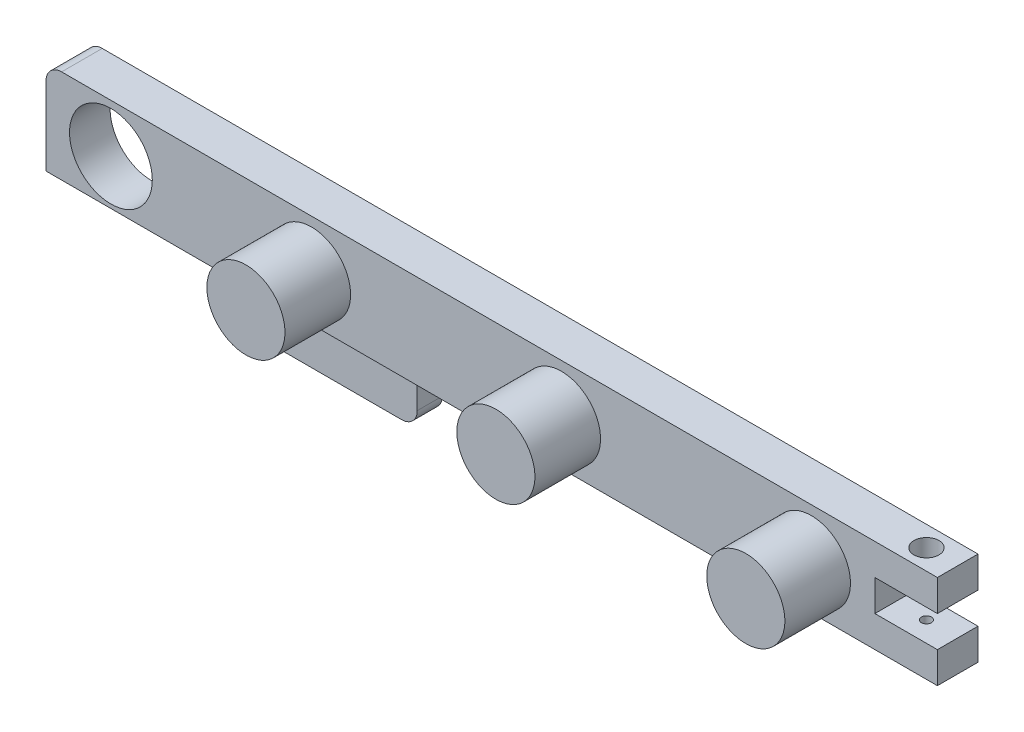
ISO-10303-21;
HEADER;
FILE_DESCRIPTION(('STEP AP214'),'2;1');
FILE_NAME('part.step','',(''),(''),'','','');
FILE_SCHEMA(('AUTOMOTIVE_DESIGN { 1 0 10303 214 1 1 1 1 }'));
ENDSEC;
DATA;
#1=APPLICATION_CONTEXT('core data for automotive mechanical design processes');
#2=APPLICATION_PROTOCOL_DEFINITION('international standard','automotive_design',2000,#1);
#3=PRODUCT_CONTEXT('',#1,'mechanical');
#4=PRODUCT('Part','Part','',(#3));
#5=PRODUCT_RELATED_PRODUCT_CATEGORY('part','',(#4));
#6=PRODUCT_DEFINITION_FORMATION('','',#4);
#7=PRODUCT_DEFINITION_CONTEXT('part definition',#1,'design');
#8=PRODUCT_DEFINITION('design','',#6,#7);
#9=PRODUCT_DEFINITION_SHAPE('','',#8);
#10=(LENGTH_UNIT() NAMED_UNIT(*) SI_UNIT(.MILLI.,.METRE.));
#11=(NAMED_UNIT(*) PLANE_ANGLE_UNIT() SI_UNIT($,.RADIAN.));
#12=(NAMED_UNIT(*) SI_UNIT($,.STERADIAN.) SOLID_ANGLE_UNIT());
#13=UNCERTAINTY_MEASURE_WITH_UNIT(LENGTH_MEASURE(1.E-05),#10,'distance_accuracy_value','');
#14=(GEOMETRIC_REPRESENTATION_CONTEXT(3) GLOBAL_UNCERTAINTY_ASSIGNED_CONTEXT((#13)) GLOBAL_UNIT_ASSIGNED_CONTEXT((#10,
#11,#12)) REPRESENTATION_CONTEXT('',''));
#15=CARTESIAN_POINT('',(0.,0.,0.));
#16=DIRECTION('',(0.,0.,1.));
#17=DIRECTION('',(1.,0.,0.));
#18=AXIS2_PLACEMENT_3D('',#15,#16,#17);
#19=CARTESIAN_POINT('',(85.,14.5,26.));
#20=DIRECTION('',(0.,0.,-1.));
#21=DIRECTION('',(-1.,0.,0.));
#22=AXIS2_PLACEMENT_3D('',#19,#20,#21);
#23=CYLINDRICAL_SURFACE('',#22,12.5);
#24=CARTESIAN_POINT('',(85.,14.5,13.));
#25=DIRECTION('',(0.,0.,1.));
#26=DIRECTION('',(1.,0.,0.));
#27=AXIS2_PLACEMENT_3D('',#24,#25,#26);
#28=CIRCLE('',#27,12.5);
#29=CARTESIAN_POINT('',(72.5,14.5,13.));
#30=VERTEX_POINT('',#29);
#31=EDGE_CURVE('E201',#30,#30,#28,.T.);
#32=CARTESIAN_POINT('',(85.,14.5,34.));
#33=DIRECTION('',(0.,0.,1.));
#34=DIRECTION('',(1.,0.,0.));
#35=AXIS2_PLACEMENT_3D('',#32,#33,#34);
#36=CIRCLE('',#35,12.5);
#37=CARTESIAN_POINT('',(72.5,14.5,34.));
#38=VERTEX_POINT('',#37);
#39=EDGE_CURVE('E455',#38,#38,#36,.T.);
#40=CARTESIAN_POINT('',(72.5,14.5,13.));
#41=CARTESIAN_POINT('',(72.5,14.5,13.21875));
#42=CARTESIAN_POINT('',(72.5,14.5,13.4375));
#43=CARTESIAN_POINT('',(72.5,14.5,13.875));
#44=CARTESIAN_POINT('',(72.5,14.5,14.09375));
#45=CARTESIAN_POINT('',(72.5,14.5,14.53125));
#46=CARTESIAN_POINT('',(72.5,14.5,14.75));
#47=CARTESIAN_POINT('',(72.5,14.5,15.1875));
#48=CARTESIAN_POINT('',(72.5,14.5,15.40625));
#49=CARTESIAN_POINT('',(72.5,14.5,15.84375));
#50=CARTESIAN_POINT('',(72.5,14.5,16.0625));
#51=CARTESIAN_POINT('',(72.5,14.5,16.5));
#52=CARTESIAN_POINT('',(72.5,14.5,16.71875));
#53=CARTESIAN_POINT('',(72.5,14.5,17.15625));
#54=CARTESIAN_POINT('',(72.5,14.5,17.375));
#55=CARTESIAN_POINT('',(72.5,14.5,17.8125));
#56=CARTESIAN_POINT('',(72.5,14.5,18.03125));
#57=CARTESIAN_POINT('',(72.5,14.5,18.46875));
#58=CARTESIAN_POINT('',(72.5,14.5,18.6875));
#59=CARTESIAN_POINT('',(72.5,14.5,19.125));
#60=CARTESIAN_POINT('',(72.5,14.5,19.34375));
#61=CARTESIAN_POINT('',(72.5,14.5,19.78125));
#62=CARTESIAN_POINT('',(72.5,14.5,20.));
#63=CARTESIAN_POINT('',(72.5,14.5,20.4375));
#64=CARTESIAN_POINT('',(72.5,14.5,20.65625));
#65=CARTESIAN_POINT('',(72.5,14.5,21.09375));
#66=CARTESIAN_POINT('',(72.5,14.5,21.3125));
#67=CARTESIAN_POINT('',(72.5,14.5,21.75));
#68=CARTESIAN_POINT('',(72.5,14.5,21.96875));
#69=CARTESIAN_POINT('',(72.5,14.5,22.40625));
#70=CARTESIAN_POINT('',(72.5,14.5,22.625));
#71=CARTESIAN_POINT('',(72.5,14.5,23.0625));
#72=CARTESIAN_POINT('',(72.5,14.5,23.28125));
#73=CARTESIAN_POINT('',(72.5,14.5,23.71875));
#74=CARTESIAN_POINT('',(72.5,14.5,23.9375));
#75=CARTESIAN_POINT('',(72.5,14.5,24.375));
#76=CARTESIAN_POINT('',(72.5,14.5,24.59375));
#77=CARTESIAN_POINT('',(72.5,14.5,25.03125));
#78=CARTESIAN_POINT('',(72.5,14.5,25.25));
#79=CARTESIAN_POINT('',(72.5,14.5,25.6875));
#80=CARTESIAN_POINT('',(72.5,14.5,25.90625));
#81=CARTESIAN_POINT('',(72.5,14.5,26.34375));
#82=CARTESIAN_POINT('',(72.5,14.5,26.5625));
#83=CARTESIAN_POINT('',(72.5,14.5,27.));
#84=CARTESIAN_POINT('',(72.5,14.5,27.21875));
#85=CARTESIAN_POINT('',(72.5,14.5,27.65625));
#86=CARTESIAN_POINT('',(72.5,14.5,27.875));
#87=CARTESIAN_POINT('',(72.5,14.5,28.3125));
#88=CARTESIAN_POINT('',(72.5,14.5,28.53125));
#89=CARTESIAN_POINT('',(72.5,14.5,28.96875));
#90=CARTESIAN_POINT('',(72.5,14.5,29.1875));
#91=CARTESIAN_POINT('',(72.5,14.5,29.625));
#92=CARTESIAN_POINT('',(72.5,14.5,29.84375));
#93=CARTESIAN_POINT('',(72.5,14.5,30.28125));
#94=CARTESIAN_POINT('',(72.5,14.5,30.5));
#95=CARTESIAN_POINT('',(72.5,14.5,30.9375));
#96=CARTESIAN_POINT('',(72.5,14.5,31.15625));
#97=CARTESIAN_POINT('',(72.5,14.5,31.59375));
#98=CARTESIAN_POINT('',(72.5,14.5,31.8125));
#99=CARTESIAN_POINT('',(72.5,14.5,32.25));
#100=CARTESIAN_POINT('',(72.5,14.5,32.46875));
#101=CARTESIAN_POINT('',(72.5,14.5,32.90625));
#102=CARTESIAN_POINT('',(72.5,14.5,33.125));
#103=CARTESIAN_POINT('',(72.5,14.5,33.5625));
#104=CARTESIAN_POINT('',(72.5,14.5,33.78125));
#105=CARTESIAN_POINT('',(72.5,14.5,34.));
#106=B_SPLINE_CURVE_WITH_KNOTS('',3,(#40,#41,#42,#43,#44,#45,#46,#47,#48,#49,#50,#51,#52,#53,
#54,#55,#56,#57,#58,#59,#60,#61,#62,#63,#64,#65,#66,#67,#68,#69,#70,#71,#72,#73,#74,#75,#76,#77,
#78,#79,#80,#81,#82,#83,#84,#85,#86,#87,#88,#89,#90,#91,#92,#93,#94,#95,#96,#97,#98,#99,#100,
#101,#102,#103,#104,#105),.UNSPECIFIED.,.F.,.F.,(4,2,2,2,2,2,2,2,2,2,2,2,2,2,2,2,2,2,2,2,2,2,2,
2,2,2,2,2,2,2,2,2,4),(0.,0.656250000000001,1.3125,1.96875,2.625,3.28125,3.9375,4.59375,5.25,
5.90625,6.5625,7.21875,7.875,8.53125,9.1875,9.84375,10.5,11.15625,11.8125,12.46875,13.125,
13.78125,14.4375,15.09375,15.75,16.40625,17.0625,17.71875,18.375,19.03125,19.6875,20.34375,21.),.UNSPECIFIED.);
#107=EDGE_CURVE('BSEAM39',#30,#38,#106,.T.);
#108=ORIENTED_EDGE('',*,*,#31,.T.);
#109=ORIENTED_EDGE('',*,*,#39,.F.);
#110=ORIENTED_EDGE('',*,*,#107,.T.);
#111=ORIENTED_EDGE('',*,*,#107,.F.);
#112=EDGE_LOOP('',(#108,#110,#109,#111));
#113=FACE_BOUND('',#112,.T.);
#114=ADVANCED_FACE('F39',(#113),#23,.T.);
#115=CARTESIAN_POINT('',(165.,14.5,26.));
#116=DIRECTION('',(0.,0.,-1.));
#117=DIRECTION('',(-1.,0.,0.));
#118=AXIS2_PLACEMENT_3D('',#115,#116,#117);
#119=CYLINDRICAL_SURFACE('',#118,12.5);
#120=CARTESIAN_POINT('',(165.,14.5,13.));
#121=DIRECTION('',(0.,0.,1.));
#122=DIRECTION('',(1.,0.,0.));
#123=AXIS2_PLACEMENT_3D('',#120,#121,#122);
#124=CIRCLE('',#123,12.5);
#125=CARTESIAN_POINT('',(152.5,14.5,13.));
#126=VERTEX_POINT('',#125);
#127=EDGE_CURVE('E339',#126,#126,#124,.T.);
#128=CARTESIAN_POINT('',(165.,14.5,34.));
#129=DIRECTION('',(0.,0.,1.));
#130=DIRECTION('',(1.,0.,0.));
#131=AXIS2_PLACEMENT_3D('',#128,#129,#130);
#132=CIRCLE('',#131,12.5);
#133=CARTESIAN_POINT('',(152.5,14.5,34.));
#134=VERTEX_POINT('',#133);
#135=EDGE_CURVE('E457',#134,#134,#132,.T.);
#136=CARTESIAN_POINT('',(152.5,14.5,13.));
#137=CARTESIAN_POINT('',(152.5,14.5,13.21875));
#138=CARTESIAN_POINT('',(152.5,14.5,13.4375));
#139=CARTESIAN_POINT('',(152.5,14.5,13.875));
#140=CARTESIAN_POINT('',(152.5,14.5,14.09375));
#141=CARTESIAN_POINT('',(152.5,14.5,14.53125));
#142=CARTESIAN_POINT('',(152.5,14.5,14.75));
#143=CARTESIAN_POINT('',(152.5,14.5,15.1875));
#144=CARTESIAN_POINT('',(152.5,14.5,15.40625));
#145=CARTESIAN_POINT('',(152.5,14.5,15.84375));
#146=CARTESIAN_POINT('',(152.5,14.5,16.0625));
#147=CARTESIAN_POINT('',(152.5,14.5,16.5));
#148=CARTESIAN_POINT('',(152.5,14.5,16.71875));
#149=CARTESIAN_POINT('',(152.5,14.5,17.15625));
#150=CARTESIAN_POINT('',(152.5,14.5,17.375));
#151=CARTESIAN_POINT('',(152.5,14.5,17.8125));
#152=CARTESIAN_POINT('',(152.5,14.5,18.03125));
#153=CARTESIAN_POINT('',(152.5,14.5,18.46875));
#154=CARTESIAN_POINT('',(152.5,14.5,18.6875));
#155=CARTESIAN_POINT('',(152.5,14.5,19.125));
#156=CARTESIAN_POINT('',(152.5,14.5,19.34375));
#157=CARTESIAN_POINT('',(152.5,14.5,19.78125));
#158=CARTESIAN_POINT('',(152.5,14.5,20.));
#159=CARTESIAN_POINT('',(152.5,14.5,20.4375));
#160=CARTESIAN_POINT('',(152.5,14.5,20.65625));
#161=CARTESIAN_POINT('',(152.5,14.5,21.09375));
#162=CARTESIAN_POINT('',(152.5,14.5,21.3125));
#163=CARTESIAN_POINT('',(152.5,14.5,21.75));
#164=CARTESIAN_POINT('',(152.5,14.5,21.96875));
#165=CARTESIAN_POINT('',(152.5,14.5,22.40625));
#166=CARTESIAN_POINT('',(152.5,14.5,22.625));
#167=CARTESIAN_POINT('',(152.5,14.5,23.0625));
#168=CARTESIAN_POINT('',(152.5,14.5,23.28125));
#169=CARTESIAN_POINT('',(152.5,14.5,23.71875));
#170=CARTESIAN_POINT('',(152.5,14.5,23.9375));
#171=CARTESIAN_POINT('',(152.5,14.5,24.375));
#172=CARTESIAN_POINT('',(152.5,14.5,24.59375));
#173=CARTESIAN_POINT('',(152.5,14.5,25.03125));
#174=CARTESIAN_POINT('',(152.5,14.5,25.25));
#175=CARTESIAN_POINT('',(152.5,14.5,25.6875));
#176=CARTESIAN_POINT('',(152.5,14.5,25.90625));
#177=CARTESIAN_POINT('',(152.5,14.5,26.34375));
#178=CARTESIAN_POINT('',(152.5,14.5,26.5625));
#179=CARTESIAN_POINT('',(152.5,14.5,27.));
#180=CARTESIAN_POINT('',(152.5,14.5,27.21875));
#181=CARTESIAN_POINT('',(152.5,14.5,27.65625));
#182=CARTESIAN_POINT('',(152.5,14.5,27.875));
#183=CARTESIAN_POINT('',(152.5,14.5,28.3125));
#184=CARTESIAN_POINT('',(152.5,14.5,28.53125));
#185=CARTESIAN_POINT('',(152.5,14.5,28.96875));
#186=CARTESIAN_POINT('',(152.5,14.5,29.1875));
#187=CARTESIAN_POINT('',(152.5,14.5,29.625));
#188=CARTESIAN_POINT('',(152.5,14.5,29.84375));
#189=CARTESIAN_POINT('',(152.5,14.5,30.28125));
#190=CARTESIAN_POINT('',(152.5,14.5,30.5));
#191=CARTESIAN_POINT('',(152.5,14.5,30.9375));
#192=CARTESIAN_POINT('',(152.5,14.5,31.15625));
#193=CARTESIAN_POINT('',(152.5,14.5,31.59375));
#194=CARTESIAN_POINT('',(152.5,14.5,31.8125));
#195=CARTESIAN_POINT('',(152.5,14.5,32.25));
#196=CARTESIAN_POINT('',(152.5,14.5,32.46875));
#197=CARTESIAN_POINT('',(152.5,14.5,32.90625));
#198=CARTESIAN_POINT('',(152.5,14.5,33.125));
#199=CARTESIAN_POINT('',(152.5,14.5,33.5625));
#200=CARTESIAN_POINT('',(152.5,14.5,33.78125));
#201=CARTESIAN_POINT('',(152.5,14.5,34.));
#202=B_SPLINE_CURVE_WITH_KNOTS('',3,(#136,#137,#138,#139,#140,#141,#142,#143,#144,#145,#146,
#147,#148,#149,#150,#151,#152,#153,#154,#155,#156,#157,#158,#159,#160,#161,#162,#163,#164,#165,
#166,#167,#168,#169,#170,#171,#172,#173,#174,#175,#176,#177,#178,#179,#180,#181,#182,#183,#184,
#185,#186,#187,#188,#189,#190,#191,#192,#193,#194,#195,#196,#197,#198,#199,#200,#201),
.UNSPECIFIED.,.F.,.F.,(4,2,2,2,2,2,2,2,2,2,2,2,2,2,2,2,2,2,2,2,2,2,2,2,2,2,2,2,2,2,2,2,4),(0.,
0.656250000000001,1.3125,1.96875,2.625,3.28125,3.9375,4.59375,5.25,5.90625,6.5625,7.21875,7.875,
8.53125,9.1875,9.84375,10.5,11.15625,11.8125,12.46875,13.125,13.78125,14.4375,15.09375,15.75,
16.40625,17.0625,17.71875,18.375,19.03125,19.6875,20.34375,21.),.UNSPECIFIED.);
#203=EDGE_CURVE('BSEAM362',#126,#134,#202,.T.);
#204=ORIENTED_EDGE('',*,*,#127,.T.);
#205=ORIENTED_EDGE('',*,*,#135,.F.);
#206=ORIENTED_EDGE('',*,*,#203,.T.);
#207=ORIENTED_EDGE('',*,*,#203,.F.);
#208=EDGE_LOOP('',(#204,#206,#205,#207));
#209=FACE_BOUND('',#208,.T.);
#210=ADVANCED_FACE('F362',(#209),#119,.T.);
#211=CARTESIAN_POINT('',(245.,14.5,26.));
#212=DIRECTION('',(0.,0.,-1.));
#213=DIRECTION('',(-1.,0.,0.));
#214=AXIS2_PLACEMENT_3D('',#211,#212,#213);
#215=CYLINDRICAL_SURFACE('',#214,12.5);
#216=CARTESIAN_POINT('',(245.,14.5,13.));
#217=DIRECTION('',(0.,0.,1.));
#218=DIRECTION('',(1.,0.,0.));
#219=AXIS2_PLACEMENT_3D('',#216,#217,#218);
#220=CIRCLE('',#219,12.5);
#221=CARTESIAN_POINT('',(232.5,14.5,13.));
#222=VERTEX_POINT('',#221);
#223=EDGE_CURVE('E336',#222,#222,#220,.T.);
#224=CARTESIAN_POINT('',(245.,14.5,34.));
#225=DIRECTION('',(0.,0.,1.));
#226=DIRECTION('',(1.,0.,0.));
#227=AXIS2_PLACEMENT_3D('',#224,#225,#226);
#228=CIRCLE('',#227,12.5);
#229=CARTESIAN_POINT('',(232.5,14.5,34.));
#230=VERTEX_POINT('',#229);
#231=EDGE_CURVE('E461',#230,#230,#228,.T.);
#232=CARTESIAN_POINT('',(232.5,14.5,13.));
#233=CARTESIAN_POINT('',(232.5,14.5,13.21875));
#234=CARTESIAN_POINT('',(232.5,14.5,13.4375));
#235=CARTESIAN_POINT('',(232.5,14.5,13.875));
#236=CARTESIAN_POINT('',(232.5,14.5,14.09375));
#237=CARTESIAN_POINT('',(232.5,14.5,14.53125));
#238=CARTESIAN_POINT('',(232.5,14.5,14.75));
#239=CARTESIAN_POINT('',(232.5,14.5,15.1875));
#240=CARTESIAN_POINT('',(232.5,14.5,15.40625));
#241=CARTESIAN_POINT('',(232.5,14.5,15.84375));
#242=CARTESIAN_POINT('',(232.5,14.5,16.0625));
#243=CARTESIAN_POINT('',(232.5,14.5,16.5));
#244=CARTESIAN_POINT('',(232.5,14.5,16.71875));
#245=CARTESIAN_POINT('',(232.5,14.5,17.15625));
#246=CARTESIAN_POINT('',(232.5,14.5,17.375));
#247=CARTESIAN_POINT('',(232.5,14.5,17.8125));
#248=CARTESIAN_POINT('',(232.5,14.5,18.03125));
#249=CARTESIAN_POINT('',(232.5,14.5,18.46875));
#250=CARTESIAN_POINT('',(232.5,14.5,18.6875));
#251=CARTESIAN_POINT('',(232.5,14.5,19.125));
#252=CARTESIAN_POINT('',(232.5,14.5,19.34375));
#253=CARTESIAN_POINT('',(232.5,14.5,19.78125));
#254=CARTESIAN_POINT('',(232.5,14.5,20.));
#255=CARTESIAN_POINT('',(232.5,14.5,20.4375));
#256=CARTESIAN_POINT('',(232.5,14.5,20.65625));
#257=CARTESIAN_POINT('',(232.5,14.5,21.09375));
#258=CARTESIAN_POINT('',(232.5,14.5,21.3125));
#259=CARTESIAN_POINT('',(232.5,14.5,21.75));
#260=CARTESIAN_POINT('',(232.5,14.5,21.96875));
#261=CARTESIAN_POINT('',(232.5,14.5,22.40625));
#262=CARTESIAN_POINT('',(232.5,14.5,22.625));
#263=CARTESIAN_POINT('',(232.5,14.5,23.0625));
#264=CARTESIAN_POINT('',(232.5,14.5,23.28125));
#265=CARTESIAN_POINT('',(232.5,14.5,23.71875));
#266=CARTESIAN_POINT('',(232.5,14.5,23.9375));
#267=CARTESIAN_POINT('',(232.5,14.5,24.375));
#268=CARTESIAN_POINT('',(232.5,14.5,24.59375));
#269=CARTESIAN_POINT('',(232.5,14.5,25.03125));
#270=CARTESIAN_POINT('',(232.5,14.5,25.25));
#271=CARTESIAN_POINT('',(232.5,14.5,25.6875));
#272=CARTESIAN_POINT('',(232.5,14.5,25.90625));
#273=CARTESIAN_POINT('',(232.5,14.5,26.34375));
#274=CARTESIAN_POINT('',(232.5,14.5,26.5625));
#275=CARTESIAN_POINT('',(232.5,14.5,27.));
#276=CARTESIAN_POINT('',(232.5,14.5,27.21875));
#277=CARTESIAN_POINT('',(232.5,14.5,27.65625));
#278=CARTESIAN_POINT('',(232.5,14.5,27.875));
#279=CARTESIAN_POINT('',(232.5,14.5,28.3125));
#280=CARTESIAN_POINT('',(232.5,14.5,28.53125));
#281=CARTESIAN_POINT('',(232.5,14.5,28.96875));
#282=CARTESIAN_POINT('',(232.5,14.5,29.1875));
#283=CARTESIAN_POINT('',(232.5,14.5,29.625));
#284=CARTESIAN_POINT('',(232.5,14.5,29.84375));
#285=CARTESIAN_POINT('',(232.5,14.5,30.28125));
#286=CARTESIAN_POINT('',(232.5,14.5,30.5));
#287=CARTESIAN_POINT('',(232.5,14.5,30.9375));
#288=CARTESIAN_POINT('',(232.5,14.5,31.15625));
#289=CARTESIAN_POINT('',(232.5,14.5,31.59375));
#290=CARTESIAN_POINT('',(232.5,14.5,31.8125));
#291=CARTESIAN_POINT('',(232.5,14.5,32.25));
#292=CARTESIAN_POINT('',(232.5,14.5,32.46875));
#293=CARTESIAN_POINT('',(232.5,14.5,32.90625));
#294=CARTESIAN_POINT('',(232.5,14.5,33.125));
#295=CARTESIAN_POINT('',(232.5,14.5,33.5625));
#296=CARTESIAN_POINT('',(232.5,14.5,33.78125));
#297=CARTESIAN_POINT('',(232.5,14.5,34.));
#298=B_SPLINE_CURVE_WITH_KNOTS('',3,(#232,#233,#234,#235,#236,#237,#238,#239,#240,#241,#242,
#243,#244,#245,#246,#247,#248,#249,#250,#251,#252,#253,#254,#255,#256,#257,#258,#259,#260,#261,
#262,#263,#264,#265,#266,#267,#268,#269,#270,#271,#272,#273,#274,#275,#276,#277,#278,#279,#280,
#281,#282,#283,#284,#285,#286,#287,#288,#289,#290,#291,#292,#293,#294,#295,#296,#297),
.UNSPECIFIED.,.F.,.F.,(4,2,2,2,2,2,2,2,2,2,2,2,2,2,2,2,2,2,2,2,2,2,2,2,2,2,2,2,2,2,2,2,4),(0.,
0.656250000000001,1.3125,1.96875,2.625,3.28125,3.9375,4.59375,5.25,5.90625,6.5625,7.21875,7.875,
8.53125,9.1875,9.84375,10.5,11.15625,11.8125,12.46875,13.125,13.78125,14.4375,15.09375,15.75,
16.40625,17.0625,17.71875,18.375,19.03125,19.6875,20.34375,21.),.UNSPECIFIED.);
#299=EDGE_CURVE('BSEAM367',#222,#230,#298,.T.);
#300=ORIENTED_EDGE('',*,*,#223,.T.);
#301=ORIENTED_EDGE('',*,*,#231,.F.);
#302=ORIENTED_EDGE('',*,*,#299,.T.);
#303=ORIENTED_EDGE('',*,*,#299,.F.);
#304=EDGE_LOOP('',(#300,#302,#301,#303));
#305=FACE_BOUND('',#304,.T.);
#306=ADVANCED_FACE('F367',(#305),#215,.T.);
#307=CARTESIAN_POINT('',(275.325,-17.,6.5));
#308=DIRECTION('',(0.,1.,0.));
#309=DIRECTION('',(-1.,0.,0.));
#310=AXIS2_PLACEMENT_3D('',#307,#308,#309);
#311=CYLINDRICAL_SURFACE('',#310,1.59999999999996);
#312=CARTESIAN_POINT('',(275.325,10.,6.5));
#313=DIRECTION('',(0.,1.,0.));
#314=DIRECTION('',(-1.,0.,0.));
#315=AXIS2_PLACEMENT_3D('',#312,#313,#314);
#316=CIRCLE('',#315,1.59999999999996);
#317=CARTESIAN_POINT('',(273.725,10.,6.5));
#318=VERTEX_POINT('',#317);
#319=EDGE_CURVE('E238',#318,#318,#316,.T.);
#320=ORIENTED_EDGE('',*,*,#319,.T.);
#321=EDGE_LOOP('',(#320));
#322=FACE_BOUND('',#321,.T.);
#323=CARTESIAN_POINT('',(275.325,7.5,6.5));
#324=DIRECTION('',(0.,-1.,0.));
#325=DIRECTION('',(0.,0.,-1.));
#326=AXIS2_PLACEMENT_3D('',#323,#324,#325);
#327=CIRCLE('',#326,1.59999999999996);
#328=CARTESIAN_POINT('',(275.325,7.5,4.90000000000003));
#329=VERTEX_POINT('',#328);
#330=EDGE_CURVE('E43',#329,#329,#327,.F.);
#331=ORIENTED_EDGE('',*,*,#330,.F.);
#332=EDGE_LOOP('',(#331));
#333=FACE_BOUND('',#332,.T.);
#334=ADVANCED_FACE('F373',(#322,#333),#311,.F.);
#335=CARTESIAN_POINT('',(275.325,20.,6.5));
#336=DIRECTION('',(0.,1.,0.));
#337=DIRECTION('',(-1.,0.,0.));
#338=AXIS2_PLACEMENT_3D('',#335,#336,#337);
#339=CIRCLE('',#338,1.59999999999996);
#340=CARTESIAN_POINT('',(273.725,20.,6.5));
#341=VERTEX_POINT('',#340);
#342=EDGE_CURVE('E240',#341,#341,#339,.T.);
#343=ORIENTED_EDGE('',*,*,#342,.F.);
#344=EDGE_LOOP('',(#343));
#345=FACE_BOUND('',#344,.T.);
#346=CARTESIAN_POINT('',(275.325,22.5,6.5));
#347=DIRECTION('',(0.,1.,0.));
#348=DIRECTION('',(-1.,0.,0.));
#349=AXIS2_PLACEMENT_3D('',#346,#347,#348);
#350=CIRCLE('',#349,1.59999999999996);
#351=CARTESIAN_POINT('',(273.725,22.5,6.5));
#352=VERTEX_POINT('',#351);
#353=EDGE_CURVE('E241',#352,#352,#350,.F.);
#354=ORIENTED_EDGE('',*,*,#353,.F.);
#355=EDGE_LOOP('',(#354));
#356=FACE_BOUND('',#355,.T.);
#357=ADVANCED_FACE('F424',(#345,#356),#311,.F.);
#358=CARTESIAN_POINT('',(50.,0.,13.));
#359=DIRECTION('',(1.,0.,0.));
#360=DIRECTION('',(0.,0.,-1.));
#361=AXIS2_PLACEMENT_3D('',#358,#359,#360);
#362=PLANE('',#361);
#363=DIRECTION('',(0.,-1.,0.));
#364=VECTOR('',#363,1.);
#365=CARTESIAN_POINT('',(50.,0.,8.));
#366=LINE('',#365,#364);
#367=CARTESIAN_POINT('',(50.,-5.,8.));
#368=VERTEX_POINT('',#367);
#369=CARTESIAN_POINT('',(50.,-12.,8.));
#370=VERTEX_POINT('',#369);
#371=EDGE_CURVE('E313',#368,#370,#366,.T.);
#372=ORIENTED_EDGE('',*,*,#371,.F.);
#373=DIRECTION('',(0.,0.,-1.));
#374=VECTOR('',#373,1.);
#375=CARTESIAN_POINT('',(50.,-5.,13.));
#376=LINE('',#375,#374);
#377=CARTESIAN_POINT('',(50.,-5.,0.));
#378=VERTEX_POINT('',#377);
#379=EDGE_CURVE('E190',#368,#378,#376,.T.);
#380=ORIENTED_EDGE('',*,*,#379,.T.);
#381=DIRECTION('',(0.,-1.,0.));
#382=VECTOR('',#381,1.);
#383=CARTESIAN_POINT('',(50.,0.,0.));
#384=LINE('',#383,#382);
#385=CARTESIAN_POINT('',(50.,-12.,0.));
#386=VERTEX_POINT('',#385);
#387=EDGE_CURVE('E200',#378,#386,#384,.T.);
#388=ORIENTED_EDGE('',*,*,#387,.T.);
#389=DIRECTION('',(0.,0.,-1.));
#390=VECTOR('',#389,1.);
#391=CARTESIAN_POINT('',(50.,-12.,13.));
#392=LINE('',#391,#390);
#393=EDGE_CURVE('E224',#386,#370,#392,.F.);
#394=ORIENTED_EDGE('',*,*,#393,.T.);
#395=EDGE_LOOP('',(#372,#380,#388,#394));
#396=FACE_BOUND('',#395,.T.);
#397=ADVANCED_FACE('F490',(#396),#362,.F.);
#398=CARTESIAN_POINT('',(0.,-17.,13.));
#399=DIRECTION('',(0.,1.,0.));
#400=DIRECTION('',(0.,0.,1.));
#401=AXIS2_PLACEMENT_3D('',#398,#399,#400);
#402=PLANE('',#401);
#403=DIRECTION('',(1.,0.,0.));
#404=VECTOR('',#403,1.);
#405=CARTESIAN_POINT('',(50.,-17.,8.));
#406=LINE('',#405,#404);
#407=CARTESIAN_POINT('',(55.,-17.,8.));
#408=VERTEX_POINT('',#407);
#409=CARTESIAN_POINT('',(108.8325,-17.,8.));
#410=VERTEX_POINT('',#409);
#411=EDGE_CURVE('E64',#408,#410,#406,.T.);
#412=ORIENTED_EDGE('',*,*,#411,.F.);
#413=DIRECTION('',(0.,0.,-1.));
#414=VECTOR('',#413,1.);
#415=CARTESIAN_POINT('',(55.,-17.,13.));
#416=LINE('',#415,#414);
#417=CARTESIAN_POINT('',(55.,-17.,0.));
#418=VERTEX_POINT('',#417);
#419=EDGE_CURVE('E222',#408,#418,#416,.T.);
#420=ORIENTED_EDGE('',*,*,#419,.T.);
#421=DIRECTION('',(1.,0.,0.));
#422=VECTOR('',#421,1.);
#423=CARTESIAN_POINT('',(0.,-17.,0.));
#424=LINE('',#423,#422);
#425=CARTESIAN_POINT('',(108.8325,-17.,0.));
#426=VERTEX_POINT('',#425);
#427=EDGE_CURVE('E204',#418,#426,#424,.T.);
#428=ORIENTED_EDGE('',*,*,#427,.T.);
#429=DIRECTION('',(0.,0.,1.));
#430=VECTOR('',#429,1.);
#431=CARTESIAN_POINT('',(108.8325,-17.,13.));
#432=LINE('',#431,#430);
#433=EDGE_CURVE('E232',#426,#410,#432,.T.);
#434=ORIENTED_EDGE('',*,*,#433,.T.);
#435=EDGE_LOOP('',(#412,#420,#428,#434));
#436=FACE_BOUND('',#435,.T.);
#437=ADVANCED_FACE('F487',(#436),#402,.F.);
#438=CARTESIAN_POINT('',(55.,-12.,13.));
#439=DIRECTION('',(0.,0.,-1.));
#440=DIRECTION('',(-1.,0.,0.));
#441=AXIS2_PLACEMENT_3D('',#438,#439,#440);
#442=CYLINDRICAL_SURFACE('',#441,5.);
#443=ORIENTED_EDGE('',*,*,#419,.F.);
#444=CARTESIAN_POINT('',(55.,-12.,8.));
#445=DIRECTION('',(0.,0.,1.));
#446=DIRECTION('',(1.,0.,0.));
#447=AXIS2_PLACEMENT_3D('',#444,#445,#446);
#448=CIRCLE('',#447,5.);
#449=EDGE_CURVE('E328',#408,#370,#448,.F.);
#450=ORIENTED_EDGE('',*,*,#449,.T.);
#451=ORIENTED_EDGE('',*,*,#393,.F.);
#452=CARTESIAN_POINT('',(55.,-12.,0.));
#453=DIRECTION('',(0.,0.,1.));
#454=DIRECTION('',(1.,0.,0.));
#455=AXIS2_PLACEMENT_3D('',#452,#453,#454);
#456=CIRCLE('',#455,5.);
#457=EDGE_CURVE('E217',#418,#386,#456,.F.);
#458=ORIENTED_EDGE('',*,*,#457,.F.);
#459=EDGE_LOOP('',(#443,#450,#451,#458));
#460=FACE_BOUND('',#459,.T.);
#461=ADVANCED_FACE('F378',(#460),#442,.T.);
#462=CARTESIAN_POINT('',(113.8325,0.,26.));
#463=DIRECTION('',(-1.,0.,0.));
#464=DIRECTION('',(0.,0.,1.));
#465=AXIS2_PLACEMENT_3D('',#462,#463,#464);
#466=PLANE('',#465);
#467=DIRECTION('',(0.,1.,0.));
#468=VECTOR('',#467,1.);
#469=CARTESIAN_POINT('',(113.8325,0.,8.));
#470=LINE('',#469,#468);
#471=CARTESIAN_POINT('',(113.8325,-12.,8.));
#472=VERTEX_POINT('',#471);
#473=CARTESIAN_POINT('',(113.8325,0.,8.));
#474=VERTEX_POINT('',#473);
#475=EDGE_CURVE('E324',#472,#474,#470,.T.);
#476=ORIENTED_EDGE('',*,*,#475,.F.);
#477=DIRECTION('',(0.,0.,1.));
#478=VECTOR('',#477,1.);
#479=CARTESIAN_POINT('',(113.8325,-12.,26.));
#480=LINE('',#479,#478);
#481=CARTESIAN_POINT('',(113.8325,-12.,0.));
#482=VERTEX_POINT('',#481);
#483=EDGE_CURVE('E235',#472,#482,#480,.F.);
#484=ORIENTED_EDGE('',*,*,#483,.T.);
#485=DIRECTION('',(0.,1.,0.));
#486=VECTOR('',#485,1.);
#487=CARTESIAN_POINT('',(113.8325,0.,0.));
#488=LINE('',#487,#486);
#489=CARTESIAN_POINT('',(113.8325,0.,0.));
#490=VERTEX_POINT('',#489);
#491=EDGE_CURVE('E331',#482,#490,#488,.T.);
#492=ORIENTED_EDGE('',*,*,#491,.T.);
#493=DIRECTION('',(0.,0.,-1.));
#494=VECTOR('',#493,1.);
#495=CARTESIAN_POINT('',(113.8325,0.,26.));
#496=LINE('',#495,#494);
#497=EDGE_CURVE('E334',#474,#490,#496,.T.);
#498=ORIENTED_EDGE('',*,*,#497,.F.);
#499=EDGE_LOOP('',(#476,#484,#492,#498));
#500=FACE_BOUND('',#499,.T.);
#501=ADVANCED_FACE('F375',(#500),#466,.F.);
#502=CARTESIAN_POINT('',(108.8325,-12.,13.));
#503=DIRECTION('',(0.,0.,1.));
#504=DIRECTION('',(1.,0.,0.));
#505=AXIS2_PLACEMENT_3D('',#502,#503,#504);
#506=CYLINDRICAL_SURFACE('',#505,5.);
#507=ORIENTED_EDGE('',*,*,#483,.F.);
#508=CARTESIAN_POINT('',(108.8325,-12.,8.));
#509=DIRECTION('',(0.,0.,1.));
#510=DIRECTION('',(1.,0.,0.));
#511=AXIS2_PLACEMENT_3D('',#508,#509,#510);
#512=CIRCLE('',#511,5.);
#513=EDGE_CURVE('E11',#472,#410,#512,.F.);
#514=ORIENTED_EDGE('',*,*,#513,.T.);
#515=ORIENTED_EDGE('',*,*,#433,.F.);
#516=CARTESIAN_POINT('',(108.8325,-12.,0.));
#517=DIRECTION('',(0.,0.,1.));
#518=DIRECTION('',(1.,0.,0.));
#519=AXIS2_PLACEMENT_3D('',#516,#517,#518);
#520=CIRCLE('',#519,5.);
#521=EDGE_CURVE('E48',#482,#426,#520,.F.);
#522=ORIENTED_EDGE('',*,*,#521,.F.);
#523=EDGE_LOOP('',(#507,#514,#515,#522));
#524=FACE_BOUND('',#523,.T.);
#525=ADVANCED_FACE('F41',(#524),#506,.T.);
#526=CARTESIAN_POINT('',(0.,-5.,13.));
#527=DIRECTION('',(0.,1.,0.));
#528=DIRECTION('',(0.,0.,1.));
#529=AXIS2_PLACEMENT_3D('',#526,#527,#528);
#530=PLANE('',#529);
#531=ORIENTED_EDGE('',*,*,#379,.F.);
#532=DIRECTION('',(-1.,0.,0.));
#533=VECTOR('',#532,1.);
#534=CARTESIAN_POINT('',(0.,-5.,8.));
#535=LINE('',#534,#533);
#536=CARTESIAN_POINT('',(5.,-5.,8.));
#537=VERTEX_POINT('',#536);
#538=EDGE_CURVE('E183',#368,#537,#535,.T.);
#539=ORIENTED_EDGE('',*,*,#538,.T.);
#540=DIRECTION('',(0.,0.,-1.));
#541=VECTOR('',#540,1.);
#542=CARTESIAN_POINT('',(5.,-5.,0.));
#543=LINE('',#542,#541);
#544=CARTESIAN_POINT('',(5.,-5.,0.));
#545=VERTEX_POINT('',#544);
#546=EDGE_CURVE('E227',#537,#545,#543,.T.);
#547=ORIENTED_EDGE('',*,*,#546,.T.);
#548=DIRECTION('',(1.,0.,0.));
#549=VECTOR('',#548,1.);
#550=CARTESIAN_POINT('',(0.,-5.,0.));
#551=LINE('',#550,#549);
#552=EDGE_CURVE('E197',#545,#378,#551,.T.);
#553=ORIENTED_EDGE('',*,*,#552,.T.);
#554=EDGE_LOOP('',(#531,#539,#547,#553));
#555=FACE_BOUND('',#554,.T.);
#556=ADVANCED_FACE('F476',(#555),#530,.F.);
#557=CARTESIAN_POINT('',(0.,0.,13.));
#558=DIRECTION('',(0.,1.,0.));
#559=DIRECTION('',(0.,0.,1.));
#560=AXIS2_PLACEMENT_3D('',#557,#558,#559);
#561=PLANE('',#560);
#562=CARTESIAN_POINT('',(275.325,0.,6.5));
#563=DIRECTION('',(0.,-1.,0.));
#564=DIRECTION('',(0.,0.,-1.));
#565=AXIS2_PLACEMENT_3D('',#562,#563,#564);
#566=CIRCLE('',#565,4.24999999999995);
#567=CARTESIAN_POINT('',(275.325,0.,2.25000000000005));
#568=VERTEX_POINT('',#567);
#569=EDGE_CURVE('E182',#568,#568,#566,.T.);
#570=ORIENTED_EDGE('',*,*,#569,.F.);
#571=EDGE_LOOP('',(#570));
#572=FACE_BOUND('',#571,.T.);
#573=DIRECTION('',(1.,0.,0.));
#574=VECTOR('',#573,1.);
#575=CARTESIAN_POINT('',(0.,0.,0.));
#576=LINE('',#575,#574);
#577=CARTESIAN_POINT('',(285.325,0.,0.));
#578=VERTEX_POINT('',#577);
#579=EDGE_CURVE('E207',#490,#578,#576,.T.);
#580=ORIENTED_EDGE('',*,*,#579,.T.);
#581=DIRECTION('',(0.,0.,1.));
#582=VECTOR('',#581,1.);
#583=CARTESIAN_POINT('',(285.325,0.,0.));
#584=LINE('',#583,#582);
#585=CARTESIAN_POINT('',(285.325,0.,13.));
#586=VERTEX_POINT('',#585);
#587=EDGE_CURVE('E165',#578,#586,#584,.T.);
#588=ORIENTED_EDGE('',*,*,#587,.T.);
#589=DIRECTION('',(1.,0.,0.));
#590=VECTOR('',#589,1.);
#591=CARTESIAN_POINT('',(0.,0.,13.));
#592=LINE('',#591,#590);
#593=CARTESIAN_POINT('',(0.,0.,13.));
#594=VERTEX_POINT('',#593);
#595=EDGE_CURVE('E158',#594,#586,#592,.T.);
#596=ORIENTED_EDGE('',*,*,#595,.F.);
#597=DIRECTION('',(0.,0.,1.));
#598=VECTOR('',#597,1.);
#599=CARTESIAN_POINT('',(0.,0.,13.));
#600=LINE('',#599,#598);
#601=CARTESIAN_POINT('',(0.,0.,8.));
#602=VERTEX_POINT('',#601);
#603=EDGE_CURVE('E163',#594,#602,#600,.F.);
#604=ORIENTED_EDGE('',*,*,#603,.T.);
#605=DIRECTION('',(-1.,0.,0.));
#606=VECTOR('',#605,1.);
#607=CARTESIAN_POINT('',(50.,0.,8.));
#608=LINE('',#607,#606);
#609=EDGE_CURVE('E326',#474,#602,#608,.T.);
#610=ORIENTED_EDGE('',*,*,#609,.F.);
#611=ORIENTED_EDGE('',*,*,#497,.T.);
#612=EDGE_LOOP('',(#580,#588,#596,#604,#610,#611));
#613=FACE_BOUND('',#612,.T.);
#614=ADVANCED_FACE('F161',(#572,#613),#561,.F.);
#615=CARTESIAN_POINT('',(0.,30.,13.));
#616=DIRECTION('',(0.,1.,0.));
#617=DIRECTION('',(-1.,0.,0.));
#618=AXIS2_PLACEMENT_3D('',#615,#616,#617);
#619=PLANE('',#618);
#620=CARTESIAN_POINT('',(275.325,30.,6.5));
#621=DIRECTION('',(0.,1.,0.));
#622=DIRECTION('',(-1.,0.,0.));
#623=AXIS2_PLACEMENT_3D('',#620,#621,#622);
#624=CIRCLE('',#623,3.99999999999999);
#625=CARTESIAN_POINT('',(271.325,30.,6.5));
#626=VERTEX_POINT('',#625);
#627=EDGE_CURVE('E247',#626,#626,#624,.T.);
#628=ORIENTED_EDGE('',*,*,#627,.F.);
#629=EDGE_LOOP('',(#628));
#630=FACE_BOUND('',#629,.T.);
#631=DIRECTION('',(0.,0.,1.));
#632=VECTOR('',#631,1.);
#633=CARTESIAN_POINT('',(285.325,30.,0.));
#634=LINE('',#633,#632);
#635=CARTESIAN_POINT('',(285.325,30.,0.));
#636=VERTEX_POINT('',#635);
#637=CARTESIAN_POINT('',(285.325,30.,13.));
#638=VERTEX_POINT('',#637);
#639=EDGE_CURVE('E314',#636,#638,#634,.T.);
#640=ORIENTED_EDGE('',*,*,#639,.F.);
#641=DIRECTION('',(1.,0.,0.));
#642=VECTOR('',#641,1.);
#643=CARTESIAN_POINT('',(0.,30.,0.));
#644=LINE('',#643,#642);
#645=CARTESIAN_POINT('',(5.,30.,0.));
#646=VERTEX_POINT('',#645);
#647=EDGE_CURVE('E209',#646,#636,#644,.T.);
#648=ORIENTED_EDGE('',*,*,#647,.F.);
#649=DIRECTION('',(0.,0.,-1.));
#650=VECTOR('',#649,1.);
#651=CARTESIAN_POINT('',(5.,30.,13.));
#652=LINE('',#651,#650);
#653=CARTESIAN_POINT('',(5.,30.,13.));
#654=VERTEX_POINT('',#653);
#655=EDGE_CURVE('E220',#646,#654,#652,.F.);
#656=ORIENTED_EDGE('',*,*,#655,.T.);
#657=DIRECTION('',(1.,0.,0.));
#658=VECTOR('',#657,1.);
#659=CARTESIAN_POINT('',(0.,30.,13.));
#660=LINE('',#659,#658);
#661=EDGE_CURVE('E169',#654,#638,#660,.T.);
#662=ORIENTED_EDGE('',*,*,#661,.T.);
#663=EDGE_LOOP('',(#640,#648,#656,#662));
#664=FACE_BOUND('',#663,.T.);
#665=ADVANCED_FACE('F358',(#630,#664),#619,.T.);
#666=CARTESIAN_POINT('',(0.,0.,13.));
#667=DIRECTION('',(-1.,0.,0.));
#668=DIRECTION('',(0.,0.,1.));
#669=AXIS2_PLACEMENT_3D('',#666,#667,#668);
#670=PLANE('',#669);
#671=DIRECTION('',(0.,1.,0.));
#672=VECTOR('',#671,1.);
#673=CARTESIAN_POINT('',(0.,0.,0.));
#674=LINE('',#673,#672);
#675=CARTESIAN_POINT('',(0.,0.,0.));
#676=VERTEX_POINT('',#675);
#677=CARTESIAN_POINT('',(0.,25.,0.));
#678=VERTEX_POINT('',#677);
#679=EDGE_CURVE('E170',#676,#678,#674,.T.);
#680=ORIENTED_EDGE('',*,*,#679,.F.);
#681=DIRECTION('',(0.,0.,-1.));
#682=VECTOR('',#681,1.);
#683=CARTESIAN_POINT('',(0.,0.,13.));
#684=LINE('',#683,#682);
#685=EDGE_CURVE('E181',#676,#602,#684,.F.);
#686=ORIENTED_EDGE('',*,*,#685,.T.);
#687=ORIENTED_EDGE('',*,*,#603,.F.);
#688=DIRECTION('',(0.,1.,0.));
#689=VECTOR('',#688,1.);
#690=CARTESIAN_POINT('',(0.,0.,13.));
#691=LINE('',#690,#689);
#692=CARTESIAN_POINT('',(0.,25.,13.));
#693=VERTEX_POINT('',#692);
#694=EDGE_CURVE('E178',#594,#693,#691,.T.);
#695=ORIENTED_EDGE('',*,*,#694,.T.);
#696=DIRECTION('',(0.,0.,-1.));
#697=VECTOR('',#696,1.);
#698=CARTESIAN_POINT('',(0.,25.,13.));
#699=LINE('',#698,#697);
#700=EDGE_CURVE('E229',#693,#678,#699,.T.);
#701=ORIENTED_EDGE('',*,*,#700,.T.);
#702=EDGE_LOOP('',(#680,#686,#687,#695,#701));
#703=FACE_BOUND('',#702,.T.);
#704=ADVANCED_FACE('F176',(#703),#670,.T.);
#705=CARTESIAN_POINT('',(0.,0.,13.));
#706=DIRECTION('',(0.,0.,1.));
#707=DIRECTION('',(1.,0.,0.));
#708=AXIS2_PLACEMENT_3D('',#705,#706,#707);
#709=PLANE('',#708);
#710=ORIENTED_EDGE('',*,*,#694,.F.);
#711=ORIENTED_EDGE('',*,*,#595,.T.);
#712=DIRECTION('',(0.,-1.,0.));
#713=VECTOR('',#712,1.);
#714=CARTESIAN_POINT('',(285.325,0.,13.));
#715=LINE('',#714,#713);
#716=CARTESIAN_POINT('',(285.325,10.,13.));
#717=VERTEX_POINT('',#716);
#718=EDGE_CURVE('E309',#717,#586,#715,.T.);
#719=ORIENTED_EDGE('',*,*,#718,.F.);
#720=DIRECTION('',(-1.,0.,0.));
#721=VECTOR('',#720,1.);
#722=CARTESIAN_POINT('',(0.,9.99999999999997,13.));
#723=LINE('',#722,#721);
#724=CARTESIAN_POINT('',(265.325,10.,13.));
#725=VERTEX_POINT('',#724);
#726=EDGE_CURVE('E306',#717,#725,#723,.T.);
#727=ORIENTED_EDGE('',*,*,#726,.T.);
#728=DIRECTION('',(0.,-1.,0.));
#729=VECTOR('',#728,1.);
#730=CARTESIAN_POINT('',(265.325,0.,13.));
#731=LINE('',#730,#729);
#732=CARTESIAN_POINT('',(265.325,20.,13.));
#733=VERTEX_POINT('',#732);
#734=EDGE_CURVE('E304',#733,#725,#731,.T.);
#735=ORIENTED_EDGE('',*,*,#734,.F.);
#736=DIRECTION('',(-1.,0.,0.));
#737=VECTOR('',#736,1.);
#738=CARTESIAN_POINT('',(0.,19.9999999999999,13.));
#739=LINE('',#738,#737);
#740=CARTESIAN_POINT('',(285.325,20.,13.));
#741=VERTEX_POINT('',#740);
#742=EDGE_CURVE('E286',#741,#733,#739,.T.);
#743=ORIENTED_EDGE('',*,*,#742,.F.);
#744=EDGE_CURVE('E293',#638,#741,#715,.T.);
#745=ORIENTED_EDGE('',*,*,#744,.F.);
#746=ORIENTED_EDGE('',*,*,#661,.F.);
#747=CARTESIAN_POINT('',(5.,25.,13.));
#748=DIRECTION('',(0.,0.,1.));
#749=DIRECTION('',(1.,0.,0.));
#750=AXIS2_PLACEMENT_3D('',#747,#748,#749);
#751=CIRCLE('',#750,5.);
#752=EDGE_CURVE('E189',#654,#693,#751,.T.);
#753=ORIENTED_EDGE('',*,*,#752,.T.);
#754=EDGE_LOOP('',(#710,#711,#719,#727,#735,#743,#745,#746,#753));
#755=FACE_BOUND('',#754,.T.);
#756=CARTESIAN_POINT('',(20.775,14.5,13.));
#757=DIRECTION('',(0.,0.,1.));
#758=DIRECTION('',(1.,0.,0.));
#759=AXIS2_PLACEMENT_3D('',#756,#757,#758);
#760=CIRCLE('',#759,13.25);
#761=CARTESIAN_POINT('',(34.025,14.5,13.));
#762=VERTEX_POINT('',#761);
#763=EDGE_CURVE('E280',#762,#762,#760,.T.);
#764=ORIENTED_EDGE('',*,*,#763,.F.);
#765=EDGE_LOOP('',(#764));
#766=FACE_BOUND('',#765,.T.);
#767=ORIENTED_EDGE('',*,*,#223,.F.);
#768=EDGE_LOOP('',(#767));
#769=FACE_BOUND('',#768,.T.);
#770=ORIENTED_EDGE('',*,*,#127,.F.);
#771=EDGE_LOOP('',(#770));
#772=FACE_BOUND('',#771,.T.);
#773=ORIENTED_EDGE('',*,*,#31,.F.);
#774=EDGE_LOOP('',(#773));
#775=FACE_BOUND('',#774,.T.);
#776=ADVANCED_FACE('F185',(#755,#766,#769,#772,#775),#709,.T.);
#777=CARTESIAN_POINT('',(0.,0.,0.));
#778=DIRECTION('',(0.,0.,1.));
#779=DIRECTION('',(1.,0.,0.));
#780=AXIS2_PLACEMENT_3D('',#777,#778,#779);
#781=PLANE('',#780);
#782=CARTESIAN_POINT('',(60.,-14.5,0.));
#783=DIRECTION('',(0.,0.,1.));
#784=DIRECTION('',(1.,0.,0.));
#785=AXIS2_PLACEMENT_3D('',#782,#783,#784);
#786=CIRCLE('',#785,1.25);
#787=CARTESIAN_POINT('',(61.25,-14.5,0.));
#788=VERTEX_POINT('',#787);
#789=EDGE_CURVE('E258',#788,#788,#786,.T.);
#790=ORIENTED_EDGE('',*,*,#789,.T.);
#791=EDGE_LOOP('',(#790));
#792=FACE_BOUND('',#791,.T.);
#793=CARTESIAN_POINT('',(68.,-14.5,0.));
#794=DIRECTION('',(0.,0.,1.));
#795=DIRECTION('',(1.,0.,0.));
#796=AXIS2_PLACEMENT_3D('',#793,#794,#795);
#797=CIRCLE('',#796,1.25);
#798=CARTESIAN_POINT('',(69.25,-14.5,0.));
#799=VERTEX_POINT('',#798);
#800=EDGE_CURVE('E269',#799,#799,#797,.T.);
#801=ORIENTED_EDGE('',*,*,#800,.T.);
#802=EDGE_LOOP('',(#801));
#803=FACE_BOUND('',#802,.T.);
#804=CARTESIAN_POINT('',(68.,-2.5,0.));
#805=DIRECTION('',(0.,0.,1.));
#806=DIRECTION('',(1.,0.,0.));
#807=AXIS2_PLACEMENT_3D('',#804,#805,#806);
#808=CIRCLE('',#807,1.25);
#809=CARTESIAN_POINT('',(69.25,-2.5,0.));
#810=VERTEX_POINT('',#809);
#811=EDGE_CURVE('E263',#810,#810,#808,.T.);
#812=ORIENTED_EDGE('',*,*,#811,.T.);
#813=EDGE_LOOP('',(#812));
#814=FACE_BOUND('',#813,.T.);
#815=CARTESIAN_POINT('',(60.,-2.5,0.));
#816=DIRECTION('',(0.,0.,1.));
#817=DIRECTION('',(1.,0.,0.));
#818=AXIS2_PLACEMENT_3D('',#815,#816,#817);
#819=CIRCLE('',#818,1.25);
#820=CARTESIAN_POINT('',(61.25,-2.5,0.));
#821=VERTEX_POINT('',#820);
#822=EDGE_CURVE('E277',#821,#821,#819,.T.);
#823=ORIENTED_EDGE('',*,*,#822,.T.);
#824=EDGE_LOOP('',(#823));
#825=FACE_BOUND('',#824,.T.);
#826=CARTESIAN_POINT('',(20.775,14.5,0.));
#827=DIRECTION('',(0.,0.,1.));
#828=DIRECTION('',(1.,0.,0.));
#829=AXIS2_PLACEMENT_3D('',#826,#827,#828);
#830=CIRCLE('',#829,13.25);
#831=CARTESIAN_POINT('',(34.025,14.5,0.));
#832=VERTEX_POINT('',#831);
#833=EDGE_CURVE('E283',#832,#832,#830,.T.);
#834=ORIENTED_EDGE('',*,*,#833,.T.);
#835=EDGE_LOOP('',(#834));
#836=FACE_BOUND('',#835,.T.);
#837=ORIENTED_EDGE('',*,*,#647,.T.);
#838=DIRECTION('',(0.,-1.,0.));
#839=VECTOR('',#838,1.);
#840=CARTESIAN_POINT('',(285.325,0.,0.));
#841=LINE('',#840,#839);
#842=CARTESIAN_POINT('',(285.325,20.,0.));
#843=VERTEX_POINT('',#842);
#844=EDGE_CURVE('E301',#636,#843,#841,.T.);
#845=ORIENTED_EDGE('',*,*,#844,.T.);
#846=DIRECTION('',(-1.,0.,0.));
#847=VECTOR('',#846,1.);
#848=CARTESIAN_POINT('',(0.,19.9999999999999,0.));
#849=LINE('',#848,#847);
#850=CARTESIAN_POINT('',(265.325,20.,0.));
#851=VERTEX_POINT('',#850);
#852=EDGE_CURVE('E289',#843,#851,#849,.T.);
#853=ORIENTED_EDGE('',*,*,#852,.T.);
#854=DIRECTION('',(0.,-1.,0.));
#855=VECTOR('',#854,1.);
#856=CARTESIAN_POINT('',(265.325,0.,0.));
#857=LINE('',#856,#855);
#858=CARTESIAN_POINT('',(265.325,10.,0.));
#859=VERTEX_POINT('',#858);
#860=EDGE_CURVE('E292',#851,#859,#857,.T.);
#861=ORIENTED_EDGE('',*,*,#860,.T.);
#862=DIRECTION('',(-1.,0.,0.));
#863=VECTOR('',#862,1.);
#864=CARTESIAN_POINT('',(0.,9.99999999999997,0.));
#865=LINE('',#864,#863);
#866=CARTESIAN_POINT('',(285.325,10.,0.));
#867=VERTEX_POINT('',#866);
#868=EDGE_CURVE('E296',#867,#859,#865,.T.);
#869=ORIENTED_EDGE('',*,*,#868,.F.);
#870=EDGE_CURVE('E298',#867,#578,#841,.T.);
#871=ORIENTED_EDGE('',*,*,#870,.T.);
#872=ORIENTED_EDGE('',*,*,#579,.F.);
#873=ORIENTED_EDGE('',*,*,#491,.F.);
#874=ORIENTED_EDGE('',*,*,#521,.T.);
#875=ORIENTED_EDGE('',*,*,#427,.F.);
#876=ORIENTED_EDGE('',*,*,#457,.T.);
#877=ORIENTED_EDGE('',*,*,#387,.F.);
#878=ORIENTED_EDGE('',*,*,#552,.F.);
#879=CARTESIAN_POINT('',(5.,0.,0.));
#880=DIRECTION('',(0.,0.,1.));
#881=DIRECTION('',(1.,0.,0.));
#882=AXIS2_PLACEMENT_3D('',#879,#880,#881);
#883=CIRCLE('',#882,5.);
#884=EDGE_CURVE('E215',#545,#676,#883,.F.);
#885=ORIENTED_EDGE('',*,*,#884,.T.);
#886=ORIENTED_EDGE('',*,*,#679,.T.);
#887=CARTESIAN_POINT('',(5.,25.,0.));
#888=DIRECTION('',(0.,0.,1.));
#889=DIRECTION('',(1.,0.,0.));
#890=AXIS2_PLACEMENT_3D('',#887,#888,#889);
#891=CIRCLE('',#890,5.);
#892=EDGE_CURVE('E192',#678,#646,#891,.F.);
#893=ORIENTED_EDGE('',*,*,#892,.T.);
#894=EDGE_LOOP('',(#837,#845,#853,#861,#869,#871,#872,#873,#874,#875,#876,#877,#878,#885,#886,#893));
#895=FACE_BOUND('',#894,.T.);
#896=ADVANCED_FACE('F348',(#792,#803,#814,#825,#836,#895),#781,.F.);
#897=CARTESIAN_POINT('',(5.,0.,13.));
#898=DIRECTION('',(0.,0.,1.));
#899=DIRECTION('',(1.,0.,0.));
#900=AXIS2_PLACEMENT_3D('',#897,#898,#899);
#901=CYLINDRICAL_SURFACE('',#900,5.);
#902=CARTESIAN_POINT('',(5.,0.,8.));
#903=DIRECTION('',(0.,0.,-1.));
#904=DIRECTION('',(-1.,0.,0.));
#905=AXIS2_PLACEMENT_3D('',#902,#903,#904);
#906=CIRCLE('',#905,5.);
#907=EDGE_CURVE('E456',#602,#537,#906,.F.);
#908=ORIENTED_EDGE('',*,*,#907,.F.);
#909=ORIENTED_EDGE('',*,*,#685,.F.);
#910=ORIENTED_EDGE('',*,*,#884,.F.);
#911=ORIENTED_EDGE('',*,*,#546,.F.);
#912=EDGE_LOOP('',(#908,#909,#910,#911));
#913=FACE_BOUND('',#912,.T.);
#914=ADVANCED_FACE('F355',(#913),#901,.T.);
#915=CARTESIAN_POINT('',(5.,25.,13.));
#916=DIRECTION('',(0.,0.,-1.));
#917=DIRECTION('',(-1.,0.,0.));
#918=AXIS2_PLACEMENT_3D('',#915,#916,#917);
#919=CYLINDRICAL_SURFACE('',#918,5.);
#920=ORIENTED_EDGE('',*,*,#752,.F.);
#921=ORIENTED_EDGE('',*,*,#655,.F.);
#922=ORIENTED_EDGE('',*,*,#892,.F.);
#923=ORIENTED_EDGE('',*,*,#700,.F.);
#924=EDGE_LOOP('',(#920,#921,#922,#923));
#925=FACE_BOUND('',#924,.T.);
#926=ADVANCED_FACE('F384',(#925),#919,.T.);
#927=CARTESIAN_POINT('',(0.,0.,8.));
#928=DIRECTION('',(0.,0.,1.));
#929=DIRECTION('',(1.,0.,0.));
#930=AXIS2_PLACEMENT_3D('',#927,#928,#929);
#931=PLANE('',#930);
#932=CARTESIAN_POINT('',(60.,-14.5,8.));
#933=DIRECTION('',(0.,0.,1.));
#934=DIRECTION('',(1.,0.,0.));
#935=AXIS2_PLACEMENT_3D('',#932,#933,#934);
#936=CIRCLE('',#935,1.25);
#937=CARTESIAN_POINT('',(61.25,-14.5,8.));
#938=VERTEX_POINT('',#937);
#939=EDGE_CURVE('E272',#938,#938,#936,.T.);
#940=ORIENTED_EDGE('',*,*,#939,.F.);
#941=EDGE_LOOP('',(#940));
#942=FACE_BOUND('',#941,.T.);
#943=CARTESIAN_POINT('',(68.,-14.5,8.));
#944=DIRECTION('',(0.,0.,1.));
#945=DIRECTION('',(1.,0.,0.));
#946=AXIS2_PLACEMENT_3D('',#943,#944,#945);
#947=CIRCLE('',#946,1.25);
#948=CARTESIAN_POINT('',(69.25,-14.5,8.));
#949=VERTEX_POINT('',#948);
#950=EDGE_CURVE('E266',#949,#949,#947,.T.);
#951=ORIENTED_EDGE('',*,*,#950,.F.);
#952=EDGE_LOOP('',(#951));
#953=FACE_BOUND('',#952,.T.);
#954=CARTESIAN_POINT('',(68.,-2.5,8.));
#955=DIRECTION('',(0.,0.,1.));
#956=DIRECTION('',(1.,0.,0.));
#957=AXIS2_PLACEMENT_3D('',#954,#955,#956);
#958=CIRCLE('',#957,1.25);
#959=CARTESIAN_POINT('',(69.25,-2.5,8.));
#960=VERTEX_POINT('',#959);
#961=EDGE_CURVE('E259',#960,#960,#958,.T.);
#962=ORIENTED_EDGE('',*,*,#961,.F.);
#963=EDGE_LOOP('',(#962));
#964=FACE_BOUND('',#963,.T.);
#965=CARTESIAN_POINT('',(60.,-2.5,8.));
#966=DIRECTION('',(0.,0.,1.));
#967=DIRECTION('',(1.,0.,0.));
#968=AXIS2_PLACEMENT_3D('',#965,#966,#967);
#969=CIRCLE('',#968,1.25);
#970=CARTESIAN_POINT('',(61.25,-2.5,8.));
#971=VERTEX_POINT('',#970);
#972=EDGE_CURVE('E262',#971,#971,#969,.T.);
#973=ORIENTED_EDGE('',*,*,#972,.F.);
#974=EDGE_LOOP('',(#973));
#975=FACE_BOUND('',#974,.T.);
#976=ORIENTED_EDGE('',*,*,#411,.T.);
#977=ORIENTED_EDGE('',*,*,#513,.F.);
#978=ORIENTED_EDGE('',*,*,#475,.T.);
#979=ORIENTED_EDGE('',*,*,#609,.T.);
#980=ORIENTED_EDGE('',*,*,#907,.T.);
#981=ORIENTED_EDGE('',*,*,#538,.F.);
#982=ORIENTED_EDGE('',*,*,#371,.T.);
#983=ORIENTED_EDGE('',*,*,#449,.F.);
#984=EDGE_LOOP('',(#976,#977,#978,#979,#980,#981,#982,#983));
#985=FACE_BOUND('',#984,.T.);
#986=ADVANCED_FACE('F380',(#942,#953,#964,#975,#985),#931,.T.);
#987=CARTESIAN_POINT('',(0.,19.9999999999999,0.));
#988=DIRECTION('',(0.,1.,0.));
#989=DIRECTION('',(-1.,0.,0.));
#990=AXIS2_PLACEMENT_3D('',#987,#988,#989);
#991=PLANE('',#990);
#992=ORIENTED_EDGE('',*,*,#342,.T.);
#993=EDGE_LOOP('',(#992));
#994=FACE_BOUND('',#993,.T.);
#995=ORIENTED_EDGE('',*,*,#742,.T.);
#996=DIRECTION('',(0.,0.,1.));
#997=VECTOR('',#996,1.);
#998=CARTESIAN_POINT('',(265.325,20.,0.));
#999=LINE('',#998,#997);
#1000=EDGE_CURVE('E320',#851,#733,#999,.T.);
#1001=ORIENTED_EDGE('',*,*,#1000,.F.);
#1002=ORIENTED_EDGE('',*,*,#852,.F.);
#1003=DIRECTION('',(0.,0.,1.));
#1004=VECTOR('',#1003,1.);
#1005=CARTESIAN_POINT('',(285.325,20.,0.));
#1006=LINE('',#1005,#1004);
#1007=EDGE_CURVE('E311',#843,#741,#1006,.T.);
#1008=ORIENTED_EDGE('',*,*,#1007,.T.);
#1009=EDGE_LOOP('',(#995,#1001,#1002,#1008));
#1010=FACE_BOUND('',#1009,.T.);
#1011=ADVANCED_FACE('F383',(#994,#1010),#991,.F.);
#1012=CARTESIAN_POINT('',(285.325,0.,0.));
#1013=DIRECTION('',(-1.,0.,0.));
#1014=DIRECTION('',(0.,0.,1.));
#1015=AXIS2_PLACEMENT_3D('',#1012,#1013,#1014);
#1016=PLANE('',#1015);
#1017=ORIENTED_EDGE('',*,*,#744,.T.);
#1018=ORIENTED_EDGE('',*,*,#1007,.F.);
#1019=ORIENTED_EDGE('',*,*,#844,.F.);
#1020=ORIENTED_EDGE('',*,*,#639,.T.);
#1021=EDGE_LOOP('',(#1017,#1018,#1019,#1020));
#1022=FACE_BOUND('',#1021,.T.);
#1023=ADVANCED_FACE('F388',(#1022),#1016,.F.);
#1024=ORIENTED_EDGE('',*,*,#718,.T.);
#1025=ORIENTED_EDGE('',*,*,#587,.F.);
#1026=ORIENTED_EDGE('',*,*,#870,.F.);
#1027=DIRECTION('',(0.,0.,1.));
#1028=VECTOR('',#1027,1.);
#1029=CARTESIAN_POINT('',(285.325,10.,0.));
#1030=LINE('',#1029,#1028);
#1031=EDGE_CURVE('E317',#867,#717,#1030,.T.);
#1032=ORIENTED_EDGE('',*,*,#1031,.T.);
#1033=EDGE_LOOP('',(#1024,#1025,#1026,#1032));
#1034=FACE_BOUND('',#1033,.T.);
#1035=ADVANCED_FACE('F397',(#1034),#1016,.F.);
#1036=CARTESIAN_POINT('',(0.,9.99999999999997,0.));
#1037=DIRECTION('',(0.,1.,0.));
#1038=DIRECTION('',(-1.,0.,0.));
#1039=AXIS2_PLACEMENT_3D('',#1036,#1037,#1038);
#1040=PLANE('',#1039);
#1041=ORIENTED_EDGE('',*,*,#319,.F.);
#1042=EDGE_LOOP('',(#1041));
#1043=FACE_BOUND('',#1042,.T.);
#1044=ORIENTED_EDGE('',*,*,#726,.F.);
#1045=ORIENTED_EDGE('',*,*,#1031,.F.);
#1046=ORIENTED_EDGE('',*,*,#868,.T.);
#1047=DIRECTION('',(0.,0.,1.));
#1048=VECTOR('',#1047,1.);
#1049=CARTESIAN_POINT('',(265.325,10.,0.));
#1050=LINE('',#1049,#1048);
#1051=EDGE_CURVE('E56',#859,#725,#1050,.T.);
#1052=ORIENTED_EDGE('',*,*,#1051,.T.);
#1053=EDGE_LOOP('',(#1044,#1045,#1046,#1052));
#1054=FACE_BOUND('',#1053,.T.);
#1055=ADVANCED_FACE('F394',(#1043,#1054),#1040,.T.);
#1056=CARTESIAN_POINT('',(265.325,0.,0.));
#1057=DIRECTION('',(-1.,0.,0.));
#1058=DIRECTION('',(0.,0.,1.));
#1059=AXIS2_PLACEMENT_3D('',#1056,#1057,#1058);
#1060=PLANE('',#1059);
#1061=ORIENTED_EDGE('',*,*,#734,.T.);
#1062=ORIENTED_EDGE('',*,*,#1051,.F.);
#1063=ORIENTED_EDGE('',*,*,#860,.F.);
#1064=ORIENTED_EDGE('',*,*,#1000,.T.);
#1065=EDGE_LOOP('',(#1061,#1062,#1063,#1064));
#1066=FACE_BOUND('',#1065,.T.);
#1067=ADVANCED_FACE('F390',(#1066),#1060,.F.);
#1068=CARTESIAN_POINT('',(20.775,14.5,0.));
#1069=DIRECTION('',(0.,0.,1.));
#1070=DIRECTION('',(1.,0.,0.));
#1071=AXIS2_PLACEMENT_3D('',#1068,#1069,#1070);
#1072=CYLINDRICAL_SURFACE('',#1071,13.25);
#1073=CARTESIAN_POINT('',(34.025,14.5,0.));
#1074=CARTESIAN_POINT('',(34.025,14.5,0.135416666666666));
#1075=CARTESIAN_POINT('',(34.025,14.5,0.270833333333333));
#1076=CARTESIAN_POINT('',(34.025,14.5,0.541666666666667));
#1077=CARTESIAN_POINT('',(34.025,14.5,0.677083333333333));
#1078=CARTESIAN_POINT('',(34.025,14.5,0.947916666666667));
#1079=CARTESIAN_POINT('',(34.025,14.5,1.08333333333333));
#1080=CARTESIAN_POINT('',(34.025,14.5,1.35416666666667));
#1081=CARTESIAN_POINT('',(34.025,14.5,1.48958333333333));
#1082=CARTESIAN_POINT('',(34.025,14.5,1.76041666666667));
#1083=CARTESIAN_POINT('',(34.025,14.5,1.89583333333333));
#1084=CARTESIAN_POINT('',(34.025,14.5,2.16666666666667));
#1085=CARTESIAN_POINT('',(34.025,14.5,2.30208333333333));
#1086=CARTESIAN_POINT('',(34.025,14.5,2.57291666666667));
#1087=CARTESIAN_POINT('',(34.025,14.5,2.70833333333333));
#1088=CARTESIAN_POINT('',(34.025,14.5,2.97916666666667));
#1089=CARTESIAN_POINT('',(34.025,14.5,3.11458333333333));
#1090=CARTESIAN_POINT('',(34.025,14.5,3.38541666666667));
#1091=CARTESIAN_POINT('',(34.025,14.5,3.52083333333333));
#1092=CARTESIAN_POINT('',(34.025,14.5,3.79166666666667));
#1093=CARTESIAN_POINT('',(34.025,14.5,3.92708333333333));
#1094=CARTESIAN_POINT('',(34.025,14.5,4.19791666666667));
#1095=CARTESIAN_POINT('',(34.025,14.5,4.33333333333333));
#1096=CARTESIAN_POINT('',(34.025,14.5,4.60416666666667));
#1097=CARTESIAN_POINT('',(34.025,14.5,4.73958333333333));
#1098=CARTESIAN_POINT('',(34.025,14.5,5.01041666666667));
#1099=CARTESIAN_POINT('',(34.025,14.5,5.14583333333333));
#1100=CARTESIAN_POINT('',(34.025,14.5,5.41666666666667));
#1101=CARTESIAN_POINT('',(34.025,14.5,5.55208333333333));
#1102=CARTESIAN_POINT('',(34.025,14.5,5.82291666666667));
#1103=CARTESIAN_POINT('',(34.025,14.5,5.95833333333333));
#1104=CARTESIAN_POINT('',(34.025,14.5,6.22916666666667));
#1105=CARTESIAN_POINT('',(34.025,14.5,6.36458333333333));
#1106=CARTESIAN_POINT('',(34.025,14.5,6.63541666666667));
#1107=CARTESIAN_POINT('',(34.025,14.5,6.77083333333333));
#1108=CARTESIAN_POINT('',(34.025,14.5,7.04166666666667));
#1109=CARTESIAN_POINT('',(34.025,14.5,7.17708333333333));
#1110=CARTESIAN_POINT('',(34.025,14.5,7.44791666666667));
#1111=CARTESIAN_POINT('',(34.025,14.5,7.58333333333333));
#1112=CARTESIAN_POINT('',(34.025,14.5,7.85416666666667));
#1113=CARTESIAN_POINT('',(34.025,14.5,7.98958333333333));
#1114=CARTESIAN_POINT('',(34.025,14.5,8.26041666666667));
#1115=CARTESIAN_POINT('',(34.025,14.5,8.39583333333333));
#1116=CARTESIAN_POINT('',(34.025,14.5,8.66666666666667));
#1117=CARTESIAN_POINT('',(34.025,14.5,8.80208333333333));
#1118=CARTESIAN_POINT('',(34.025,14.5,9.07291666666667));
#1119=CARTESIAN_POINT('',(34.025,14.5,9.20833333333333));
#1120=CARTESIAN_POINT('',(34.025,14.5,9.47916666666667));
#1121=CARTESIAN_POINT('',(34.025,14.5,9.61458333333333));
#1122=CARTESIAN_POINT('',(34.025,14.5,9.88541666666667));
#1123=CARTESIAN_POINT('',(34.025,14.5,10.0208333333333));
#1124=CARTESIAN_POINT('',(34.025,14.5,10.2916666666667));
#1125=CARTESIAN_POINT('',(34.025,14.5,10.4270833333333));
#1126=CARTESIAN_POINT('',(34.025,14.5,10.6979166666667));
#1127=CARTESIAN_POINT('',(34.025,14.5,10.8333333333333));
#1128=CARTESIAN_POINT('',(34.025,14.5,11.1041666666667));
#1129=CARTESIAN_POINT('',(34.025,14.5,11.2395833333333));
#1130=CARTESIAN_POINT('',(34.025,14.5,11.5104166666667));
#1131=CARTESIAN_POINT('',(34.025,14.5,11.6458333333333));
#1132=CARTESIAN_POINT('',(34.025,14.5,11.9166666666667));
#1133=CARTESIAN_POINT('',(34.025,14.5,12.0520833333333));
#1134=CARTESIAN_POINT('',(34.025,14.5,12.3229166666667));
#1135=CARTESIAN_POINT('',(34.025,14.5,12.4583333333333));
#1136=CARTESIAN_POINT('',(34.025,14.5,12.7291666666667));
#1137=CARTESIAN_POINT('',(34.025,14.5,12.8645833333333));
#1138=CARTESIAN_POINT('',(34.025,14.5,13.));
#1139=B_SPLINE_CURVE_WITH_KNOTS('',3,(#1073,#1074,#1075,#1076,#1077,#1078,#1079,#1080,#1081,
#1082,#1083,#1084,#1085,#1086,#1087,#1088,#1089,#1090,#1091,#1092,#1093,#1094,#1095,#1096,#1097,
#1098,#1099,#1100,#1101,#1102,#1103,#1104,#1105,#1106,#1107,#1108,#1109,#1110,#1111,#1112,#1113,
#1114,#1115,#1116,#1117,#1118,#1119,#1120,#1121,#1122,#1123,#1124,#1125,#1126,#1127,#1128,#1129,
#1130,#1131,#1132,#1133,#1134,#1135,#1136,#1137,#1138),.UNSPECIFIED.,.F.,.F.,(4,2,2,2,2,2,2,2,2,
2,2,2,2,2,2,2,2,2,2,2,2,2,2,2,2,2,2,2,2,2,2,2,4),(0.,0.40625,0.8125,1.21875,1.625,2.03125,
2.4375,2.84375,3.25,3.65625,4.0625,4.46875,4.875,5.28125,5.6875,6.09375,6.5,6.90625,7.3125,
7.71875,8.125,8.53125,8.9375,9.34375,9.75,10.15625,10.5625,10.96875,11.375,11.78125,12.1875,
12.59375,13.),.UNSPECIFIED.);
#1140=EDGE_CURVE('BSEAM393',#832,#762,#1139,.T.);
#1141=ORIENTED_EDGE('',*,*,#833,.F.);
#1142=ORIENTED_EDGE('',*,*,#763,.T.);
#1143=ORIENTED_EDGE('',*,*,#1140,.T.);
#1144=ORIENTED_EDGE('',*,*,#1140,.F.);
#1145=EDGE_LOOP('',(#1141,#1143,#1142,#1144));
#1146=FACE_BOUND('',#1145,.T.);
#1147=ADVANCED_FACE('F393',(#1146),#1072,.F.);
#1148=CARTESIAN_POINT('',(60.,-2.5,0.));
#1149=DIRECTION('',(0.,0.,1.));
#1150=DIRECTION('',(1.,0.,0.));
#1151=AXIS2_PLACEMENT_3D('',#1148,#1149,#1150);
#1152=CYLINDRICAL_SURFACE('',#1151,1.25);
#1153=ORIENTED_EDGE('',*,*,#822,.F.);
#1154=EDGE_LOOP('',(#1153));
#1155=FACE_BOUND('',#1154,.T.);
#1156=ORIENTED_EDGE('',*,*,#972,.T.);
#1157=EDGE_LOOP('',(#1156));
#1158=FACE_BOUND('',#1157,.T.);
#1159=ADVANCED_FACE('F404',(#1155,#1158),#1152,.F.);
#1160=CARTESIAN_POINT('',(68.,-2.5,0.));
#1161=DIRECTION('',(0.,0.,1.));
#1162=DIRECTION('',(1.,0.,0.));
#1163=AXIS2_PLACEMENT_3D('',#1160,#1161,#1162);
#1164=CYLINDRICAL_SURFACE('',#1163,1.25);
#1165=ORIENTED_EDGE('',*,*,#811,.F.);
#1166=EDGE_LOOP('',(#1165));
#1167=FACE_BOUND('',#1166,.T.);
#1168=ORIENTED_EDGE('',*,*,#961,.T.);
#1169=EDGE_LOOP('',(#1168));
#1170=FACE_BOUND('',#1169,.T.);
#1171=ADVANCED_FACE('F408',(#1167,#1170),#1164,.F.);
#1172=CARTESIAN_POINT('',(68.,-14.5,0.));
#1173=DIRECTION('',(0.,0.,1.));
#1174=DIRECTION('',(1.,0.,0.));
#1175=AXIS2_PLACEMENT_3D('',#1172,#1173,#1174);
#1176=CYLINDRICAL_SURFACE('',#1175,1.25);
#1177=ORIENTED_EDGE('',*,*,#800,.F.);
#1178=EDGE_LOOP('',(#1177));
#1179=FACE_BOUND('',#1178,.T.);
#1180=ORIENTED_EDGE('',*,*,#950,.T.);
#1181=EDGE_LOOP('',(#1180));
#1182=FACE_BOUND('',#1181,.T.);
#1183=ADVANCED_FACE('F414',(#1179,#1182),#1176,.F.);
#1184=CARTESIAN_POINT('',(60.,-14.5,0.));
#1185=DIRECTION('',(0.,0.,1.));
#1186=DIRECTION('',(1.,0.,0.));
#1187=AXIS2_PLACEMENT_3D('',#1184,#1185,#1186);
#1188=CYLINDRICAL_SURFACE('',#1187,1.25);
#1189=ORIENTED_EDGE('',*,*,#789,.F.);
#1190=EDGE_LOOP('',(#1189));
#1191=FACE_BOUND('',#1190,.T.);
#1192=ORIENTED_EDGE('',*,*,#939,.T.);
#1193=EDGE_LOOP('',(#1192));
#1194=FACE_BOUND('',#1193,.T.);
#1195=ADVANCED_FACE('F410',(#1191,#1194),#1188,.F.);
#1196=CARTESIAN_POINT('',(275.325,22.5,6.5));
#1197=DIRECTION('',(0.,1.,0.));
#1198=DIRECTION('',(-1.,0.,0.));
#1199=AXIS2_PLACEMENT_3D('',#1196,#1197,#1198);
#1200=PLANE('',#1199);
#1201=CARTESIAN_POINT('',(275.325,22.5,6.5));
#1202=DIRECTION('',(0.,1.,0.));
#1203=DIRECTION('',(-1.,0.,0.));
#1204=AXIS2_PLACEMENT_3D('',#1201,#1202,#1203);
#1205=CIRCLE('',#1204,3.99999999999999);
#1206=CARTESIAN_POINT('',(271.325,22.5,6.5));
#1207=VERTEX_POINT('',#1206);
#1208=EDGE_CURVE('E243',#1207,#1207,#1205,.T.);
#1209=ORIENTED_EDGE('',*,*,#1208,.T.);
#1210=EDGE_LOOP('',(#1209));
#1211=FACE_BOUND('',#1210,.T.);
#1212=ORIENTED_EDGE('',*,*,#353,.T.);
#1213=EDGE_LOOP('',(#1212));
#1214=FACE_BOUND('',#1213,.T.);
#1215=ADVANCED_FACE('F413',(#1211,#1214),#1200,.T.);
#1216=CARTESIAN_POINT('',(275.325,22.5,6.5));
#1217=DIRECTION('',(0.,1.,0.));
#1218=DIRECTION('',(-1.,0.,0.));
#1219=AXIS2_PLACEMENT_3D('',#1216,#1217,#1218);
#1220=CYLINDRICAL_SURFACE('',#1219,3.99999999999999);
#1221=ORIENTED_EDGE('',*,*,#1208,.F.);
#1222=EDGE_LOOP('',(#1221));
#1223=FACE_BOUND('',#1222,.T.);
#1224=ORIENTED_EDGE('',*,*,#627,.T.);
#1225=EDGE_LOOP('',(#1224));
#1226=FACE_BOUND('',#1225,.T.);
#1227=ADVANCED_FACE('F426',(#1223,#1226),#1220,.F.);
#1228=CARTESIAN_POINT('',(275.325,7.5,6.5));
#1229=DIRECTION('',(0.,-1.,0.));
#1230=DIRECTION('',(0.,0.,-1.));
#1231=AXIS2_PLACEMENT_3D('',#1228,#1229,#1230);
#1232=PLANE('',#1231);
#1233=CARTESIAN_POINT('',(275.325,7.5,6.5));
#1234=DIRECTION('',(0.,-1.,0.));
#1235=DIRECTION('',(0.,0.,-1.));
#1236=AXIS2_PLACEMENT_3D('',#1233,#1234,#1235);
#1237=CIRCLE('',#1236,4.24999999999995);
#1238=CARTESIAN_POINT('',(275.325,7.5,2.25000000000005));
#1239=VERTEX_POINT('',#1238);
#1240=EDGE_CURVE('E467',#1239,#1239,#1237,.T.);
#1241=ORIENTED_EDGE('',*,*,#1240,.T.);
#1242=EDGE_LOOP('',(#1241));
#1243=FACE_BOUND('',#1242,.T.);
#1244=ORIENTED_EDGE('',*,*,#330,.T.);
#1245=EDGE_LOOP('',(#1244));
#1246=FACE_BOUND('',#1245,.T.);
#1247=ADVANCED_FACE('F429',(#1243,#1246),#1232,.T.);
#1248=CARTESIAN_POINT('',(275.325,7.5,6.5));
#1249=DIRECTION('',(0.,-1.,0.));
#1250=DIRECTION('',(0.,0.,-1.));
#1251=AXIS2_PLACEMENT_3D('',#1248,#1249,#1250);
#1252=CYLINDRICAL_SURFACE('',#1251,4.24999999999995);
#1253=ORIENTED_EDGE('',*,*,#1240,.F.);
#1254=EDGE_LOOP('',(#1253));
#1255=FACE_BOUND('',#1254,.T.);
#1256=ORIENTED_EDGE('',*,*,#569,.T.);
#1257=EDGE_LOOP('',(#1256));
#1258=FACE_BOUND('',#1257,.T.);
#1259=ADVANCED_FACE('F433',(#1255,#1258),#1252,.F.);
#1260=CARTESIAN_POINT('',(245.,14.5,34.));
#1261=DIRECTION('',(0.,0.,1.));
#1262=DIRECTION('',(1.,0.,0.));
#1263=AXIS2_PLACEMENT_3D('',#1260,#1261,#1262);
#1264=PLANE('',#1263);
#1265=ORIENTED_EDGE('',*,*,#231,.T.);
#1266=EDGE_LOOP('',(#1265));
#1267=FACE_BOUND('',#1266,.T.);
#1268=ADVANCED_FACE('F436',(#1267),#1264,.T.);
#1269=CARTESIAN_POINT('',(165.,14.5,34.));
#1270=DIRECTION('',(0.,0.,1.));
#1271=DIRECTION('',(1.,0.,0.));
#1272=AXIS2_PLACEMENT_3D('',#1269,#1270,#1271);
#1273=PLANE('',#1272);
#1274=ORIENTED_EDGE('',*,*,#135,.T.);
#1275=EDGE_LOOP('',(#1274));
#1276=FACE_BOUND('',#1275,.T.);
#1277=ADVANCED_FACE('F443',(#1276),#1273,.T.);
#1278=CARTESIAN_POINT('',(85.,14.5,34.));
#1279=DIRECTION('',(0.,0.,1.));
#1280=DIRECTION('',(1.,0.,0.));
#1281=AXIS2_PLACEMENT_3D('',#1278,#1279,#1280);
#1282=PLANE('',#1281);
#1283=ORIENTED_EDGE('',*,*,#39,.T.);
#1284=EDGE_LOOP('',(#1283));
#1285=FACE_BOUND('',#1284,.T.);
#1286=ADVANCED_FACE('F447',(#1285),#1282,.T.);
#1287=CLOSED_SHELL('',(#114,#210,#306,#334,#357,#397,#437,#461,#501,#525,#556,#614,#665,#704,
#776,#896,#914,#926,#986,#1011,#1023,#1035,#1055,#1067,#1147,#1159,#1171,#1183,#1195,#1215,
#1227,#1247,#1259,#1268,#1277,#1286));
#1288=MANIFOLD_SOLID_BREP('B2',#1287);
#1289=ADVANCED_BREP_SHAPE_REPRESENTATION('',(#18,#1288),#14);
#1290=SHAPE_DEFINITION_REPRESENTATION(#9,#1289);
ENDSEC;
END-ISO-10303-21;
